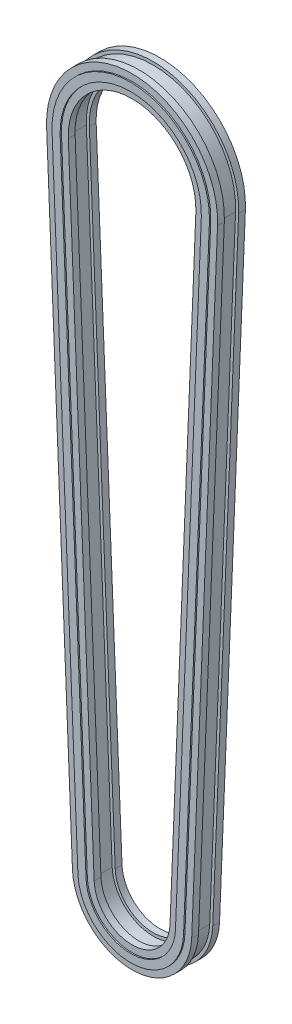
from build123d import *


with BuildPart() as part:
    # Balayage1: sweep along a path in Esquisse1
    with BuildLine(Plane.XY) as balayage1_path:
        Line((26.507685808, -1.087884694), (40.560855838, 341.335368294))
        ThreePointArc((40.560855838, 341.335368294), (0, 383.595), (-40.560855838, 341.335368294))
        Line((-40.560855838, 341.335368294), (-26.507685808, -1.087884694))
        ThreePointArc((-26.507685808, -1.087884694), (0, -26.53), (26.507685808, -1.087884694))
    # Esquisse2 → Balayage1 (sweep)
    with BuildSketch(Plane(origin=(-142.628520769, 348.853524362, 0), x_dir=(0, 0, 1), z_dir=(0.04100583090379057, 0.9991589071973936, 0))):
        Polygon((3.875, 179.093585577), (-3.875, 179.093585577), (-3.875, 177.443585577), (-7.57, 177.443585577), (-7.57, 181.143585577), (-8.3, 181.143585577), (-8.3, 185.543585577), (-7.57, 185.543585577), (-7.57, 189.243585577), (-3.875, 189.243585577), (-3.875, 187.593585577), (3.875, 187.593585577), (3.875, 189.243585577), (7.57, 189.243585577), (7.57, 185.543585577), (8.3, 185.543585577), (8.3, 181.143585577), (7.57, 181.143585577), (7.57, 177.443585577), (3.875, 177.443585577), align=None)
    sweep(path=balayage1_path.line)


solid = part.part
